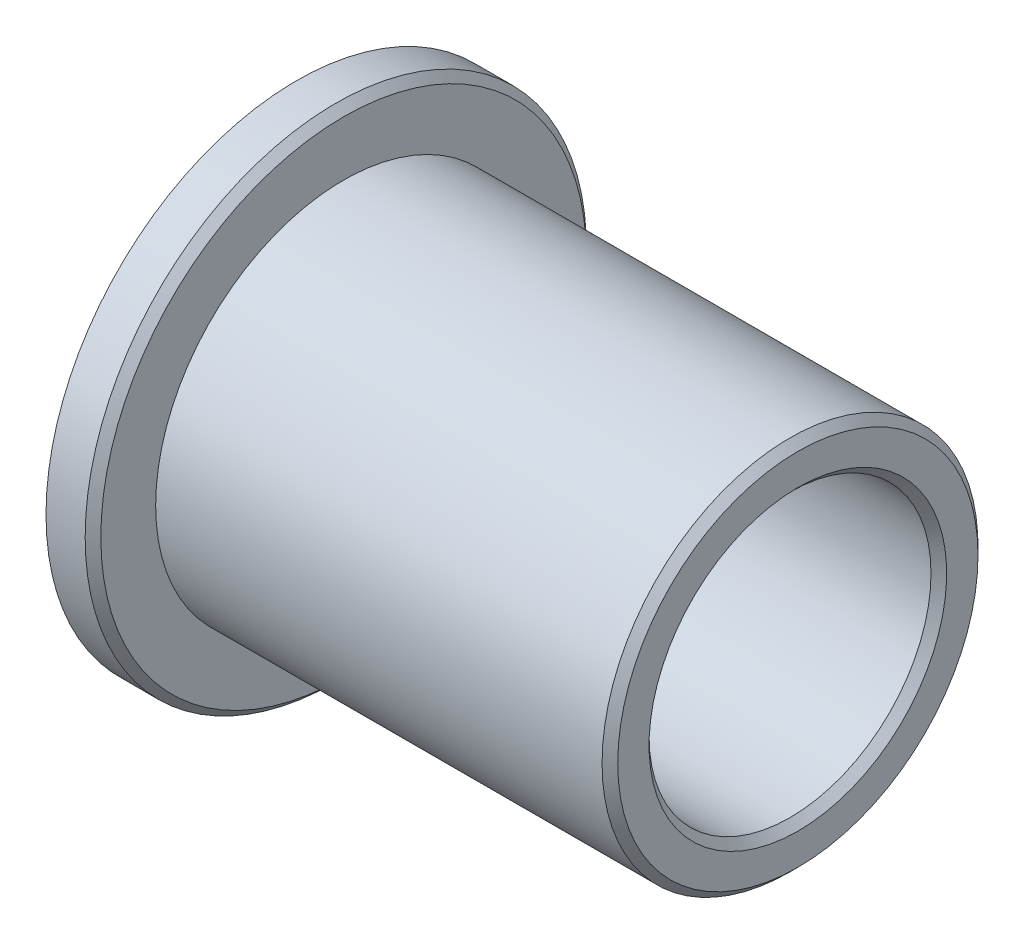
from build123d import *

# Parameters (mm, degrees)
CHANFREIN1_SIZE = 0.5


with BuildPart() as part:
    # Esquisse1 → Base-R_volution (revolve)
    with BuildSketch(Plane.XY, mode=Mode.PRIVATE) as base_r_volution_sk:
        Polygon((0, 9), (0, 16), (3, 16), (3, 12), (32, 12), (32, 9), align=None)
    revolve(base_r_volution_sk.sketch.rotate(Axis((-130, 0, 0), (1, 0, 0)), 180), axis=Axis((-130, 0, 0), (1, 0, 0)))

    # Chanfrein1
    chanfrein1_edges = [part.edges().sort_by_distance(p)[0] for p in [
        (0, 9, 0),
        (3, 16, 0),
        (32, 12, 0),
        (32, 9, 0),
    ]]
    chamfer(chanfrein1_edges, length=CHANFREIN1_SIZE)


solid = part.part
